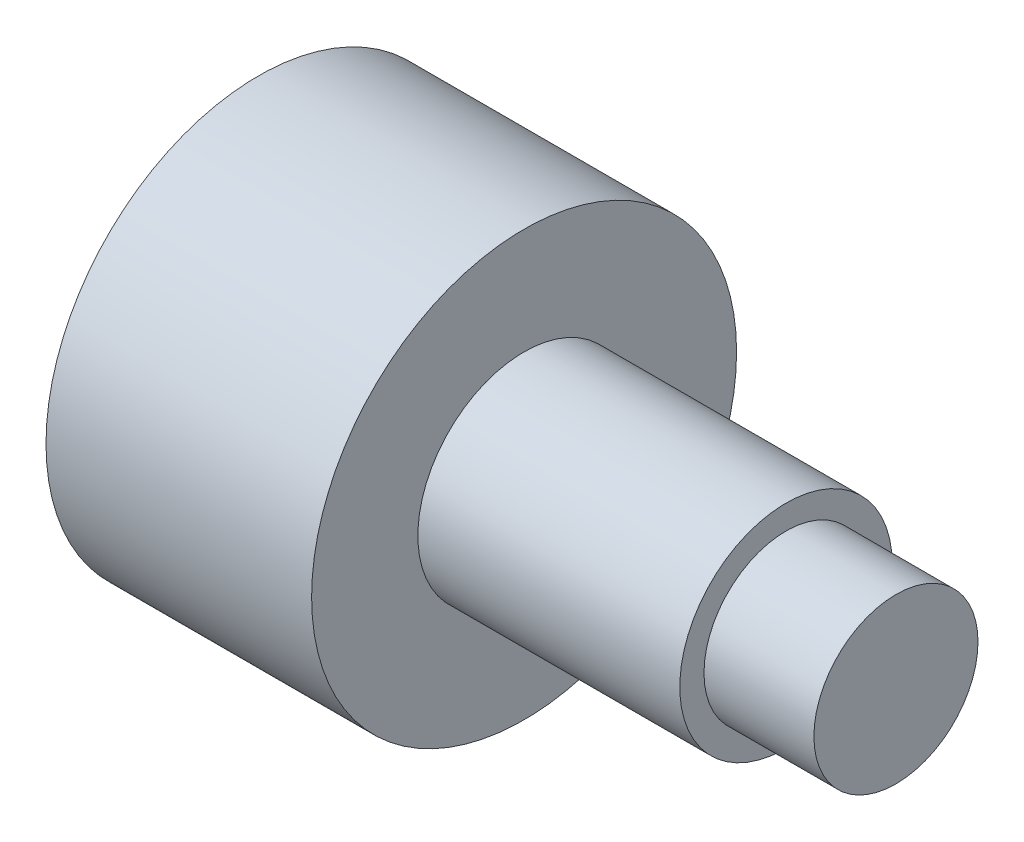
ISO-10303-21;
HEADER;
FILE_DESCRIPTION(('STEP AP214'),'2;1');
FILE_NAME('part.step','',(''),(''),'','','');
FILE_SCHEMA(('AUTOMOTIVE_DESIGN { 1 0 10303 214 1 1 1 1 }'));
ENDSEC;
DATA;
#1=APPLICATION_CONTEXT('core data for automotive mechanical design processes');
#2=APPLICATION_PROTOCOL_DEFINITION('international standard','automotive_design',2000,#1);
#3=PRODUCT_CONTEXT('',#1,'mechanical');
#4=PRODUCT('Part','Part','',(#3));
#5=PRODUCT_RELATED_PRODUCT_CATEGORY('part','',(#4));
#6=PRODUCT_DEFINITION_FORMATION('','',#4);
#7=PRODUCT_DEFINITION_CONTEXT('part definition',#1,'design');
#8=PRODUCT_DEFINITION('design','',#6,#7);
#9=PRODUCT_DEFINITION_SHAPE('','',#8);
#10=(LENGTH_UNIT() NAMED_UNIT(*) SI_UNIT(.MILLI.,.METRE.));
#11=(NAMED_UNIT(*) PLANE_ANGLE_UNIT() SI_UNIT($,.RADIAN.));
#12=(NAMED_UNIT(*) SI_UNIT($,.STERADIAN.) SOLID_ANGLE_UNIT());
#13=UNCERTAINTY_MEASURE_WITH_UNIT(LENGTH_MEASURE(1.E-05),#10,'distance_accuracy_value','');
#14=(GEOMETRIC_REPRESENTATION_CONTEXT(3) GLOBAL_UNCERTAINTY_ASSIGNED_CONTEXT((#13)) GLOBAL_UNIT_ASSIGNED_CONTEXT((#10,
#11,#12)) REPRESENTATION_CONTEXT('',''));
#15=CARTESIAN_POINT('',(0.,0.,0.));
#16=DIRECTION('',(0.,0.,1.));
#17=DIRECTION('',(1.,0.,0.));
#18=AXIS2_PLACEMENT_3D('',#15,#16,#17);
#19=CARTESIAN_POINT('',(0.,0.,0.));
#20=DIRECTION('',(1.,0.,0.));
#21=DIRECTION('',(0.,0.,-1.));
#22=AXIS2_PLACEMENT_3D('',#19,#20,#21);
#23=CYLINDRICAL_SURFACE('',#22,10.);
#24=CARTESIAN_POINT('',(25.,0.,0.));
#25=DIRECTION('',(1.,0.,0.));
#26=DIRECTION('',(0.,0.,-1.));
#27=AXIS2_PLACEMENT_3D('',#24,#25,#26);
#28=CIRCLE('',#27,10.);
#29=CARTESIAN_POINT('',(25.,0.,-10.));
#30=VERTEX_POINT('',#29);
#31=EDGE_CURVE('E38',#30,#30,#28,.T.);
#32=ORIENTED_EDGE('',*,*,#31,.T.);
#33=EDGE_LOOP('',(#32));
#34=FACE_BOUND('',#33,.T.);
#35=CARTESIAN_POINT('',(49.6537949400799,0.,0.));
#36=DIRECTION('',(1.,0.,0.));
#37=DIRECTION('',(0.,0.,-1.));
#38=AXIS2_PLACEMENT_3D('',#35,#36,#37);
#39=CIRCLE('',#38,10.);
#40=CARTESIAN_POINT('',(49.6537949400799,0.,-10.));
#41=VERTEX_POINT('',#40);
#42=EDGE_CURVE('E29',#41,#41,#39,.F.);
#43=ORIENTED_EDGE('',*,*,#42,.T.);
#44=EDGE_LOOP('',(#43));
#45=FACE_BOUND('',#44,.T.);
#46=ADVANCED_FACE('F25',(#34,#45),#23,.T.);
#47=CARTESIAN_POINT('',(0.,0.,0.));
#48=DIRECTION('',(-1.,0.,0.));
#49=DIRECTION('',(0.,0.,1.));
#50=AXIS2_PLACEMENT_3D('',#47,#48,#49);
#51=PLANE('',#50);
#52=CARTESIAN_POINT('',(0.,0.,0.));
#53=DIRECTION('',(1.,0.,0.));
#54=DIRECTION('',(0.,0.,-1.));
#55=AXIS2_PLACEMENT_3D('',#52,#53,#54);
#56=CIRCLE('',#55,20.);
#57=CARTESIAN_POINT('',(0.,0.,-20.));
#58=VERTEX_POINT('',#57);
#59=EDGE_CURVE('E10',#58,#58,#56,.T.);
#60=ORIENTED_EDGE('',*,*,#59,.F.);
#61=EDGE_LOOP('',(#60));
#62=FACE_BOUND('',#61,.T.);
#63=ADVANCED_FACE('F27',(#62),#51,.T.);
#64=CARTESIAN_POINT('',(0.,0.,0.));
#65=DIRECTION('',(1.,0.,0.));
#66=DIRECTION('',(0.,0.,-1.));
#67=AXIS2_PLACEMENT_3D('',#64,#65,#66);
#68=CYLINDRICAL_SURFACE('',#67,20.);
#69=ORIENTED_EDGE('',*,*,#59,.T.);
#70=EDGE_LOOP('',(#69));
#71=FACE_BOUND('',#70,.T.);
#72=CARTESIAN_POINT('',(25.,0.,0.));
#73=DIRECTION('',(1.,0.,0.));
#74=DIRECTION('',(0.,0.,-1.));
#75=AXIS2_PLACEMENT_3D('',#72,#73,#74);
#76=CIRCLE('',#75,20.);
#77=CARTESIAN_POINT('',(25.,0.,-20.));
#78=VERTEX_POINT('',#77);
#79=EDGE_CURVE('E33',#78,#78,#76,.T.);
#80=ORIENTED_EDGE('',*,*,#79,.F.);
#81=EDGE_LOOP('',(#80));
#82=FACE_BOUND('',#81,.T.);
#83=ADVANCED_FACE('F59',(#71,#82),#68,.T.);
#84=CARTESIAN_POINT('',(25.,20.,0.));
#85=DIRECTION('',(1.,0.,0.));
#86=DIRECTION('',(0.,0.,-1.));
#87=AXIS2_PLACEMENT_3D('',#84,#85,#86);
#88=PLANE('',#87);
#89=ORIENTED_EDGE('',*,*,#79,.T.);
#90=EDGE_LOOP('',(#89));
#91=FACE_BOUND('',#90,.T.);
#92=ORIENTED_EDGE('',*,*,#31,.F.);
#93=EDGE_LOOP('',(#92));
#94=FACE_BOUND('',#93,.T.);
#95=ADVANCED_FACE('F56',(#91,#94),#88,.T.);
#96=CARTESIAN_POINT('',(120.,0.,0.));
#97=DIRECTION('',(1.,0.,0.));
#98=DIRECTION('',(0.,0.,1.));
#99=AXIS2_PLACEMENT_3D('',#96,#97,#98);
#100=CYLINDRICAL_SURFACE('',#99,7.7230359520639);
#101=CARTESIAN_POINT('',(60.,0.,0.));
#102=DIRECTION('',(1.,0.,0.));
#103=DIRECTION('',(0.,0.,-1.));
#104=AXIS2_PLACEMENT_3D('',#101,#102,#103);
#105=CIRCLE('',#104,7.7230359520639);
#106=CARTESIAN_POINT('',(60.,0.,-7.7230359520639));
#107=VERTEX_POINT('',#106);
#108=EDGE_CURVE('E41',#107,#107,#105,.T.);
#109=ORIENTED_EDGE('',*,*,#108,.F.);
#110=EDGE_LOOP('',(#109));
#111=FACE_BOUND('',#110,.T.);
#112=CARTESIAN_POINT('',(49.6537949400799,0.,0.));
#113=DIRECTION('',(1.,0.,0.));
#114=DIRECTION('',(0.,0.,1.));
#115=AXIS2_PLACEMENT_3D('',#112,#113,#114);
#116=CIRCLE('',#115,7.7230359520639);
#117=CARTESIAN_POINT('',(49.6537949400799,0.,7.7230359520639));
#118=VERTEX_POINT('',#117);
#119=EDGE_CURVE('E43',#118,#118,#116,.T.);
#120=ORIENTED_EDGE('',*,*,#119,.T.);
#121=EDGE_LOOP('',(#120));
#122=FACE_BOUND('',#121,.T.);
#123=ADVANCED_FACE('F58',(#111,#122),#100,.T.);
#124=CARTESIAN_POINT('',(49.6537949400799,-7.7230359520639,0.));
#125=DIRECTION('',(1.,0.,0.));
#126=DIRECTION('',(0.,0.,1.));
#127=AXIS2_PLACEMENT_3D('',#124,#125,#126);
#128=PLANE('',#127);
#129=ORIENTED_EDGE('',*,*,#42,.F.);
#130=EDGE_LOOP('',(#129));
#131=FACE_BOUND('',#130,.T.);
#132=ORIENTED_EDGE('',*,*,#119,.F.);
#133=EDGE_LOOP('',(#132));
#134=FACE_BOUND('',#133,.T.);
#135=ADVANCED_FACE('F67',(#131,#134),#128,.T.);
#136=CARTESIAN_POINT('',(60.,10.,0.));
#137=DIRECTION('',(1.,0.,0.));
#138=DIRECTION('',(0.,0.,-1.));
#139=AXIS2_PLACEMENT_3D('',#136,#137,#138);
#140=PLANE('',#139);
#141=ORIENTED_EDGE('',*,*,#108,.T.);
#142=EDGE_LOOP('',(#141));
#143=FACE_BOUND('',#142,.T.);
#144=ADVANCED_FACE('F76',(#143),#140,.T.);
#145=CLOSED_SHELL('',(#46,#63,#83,#95,#123,#135,#144));
#146=MANIFOLD_SOLID_BREP('B2',#145);
#147=ADVANCED_BREP_SHAPE_REPRESENTATION('',(#18,#146),#14);
#148=SHAPE_DEFINITION_REPRESENTATION(#9,#147);
ENDSEC;
END-ISO-10303-21;
